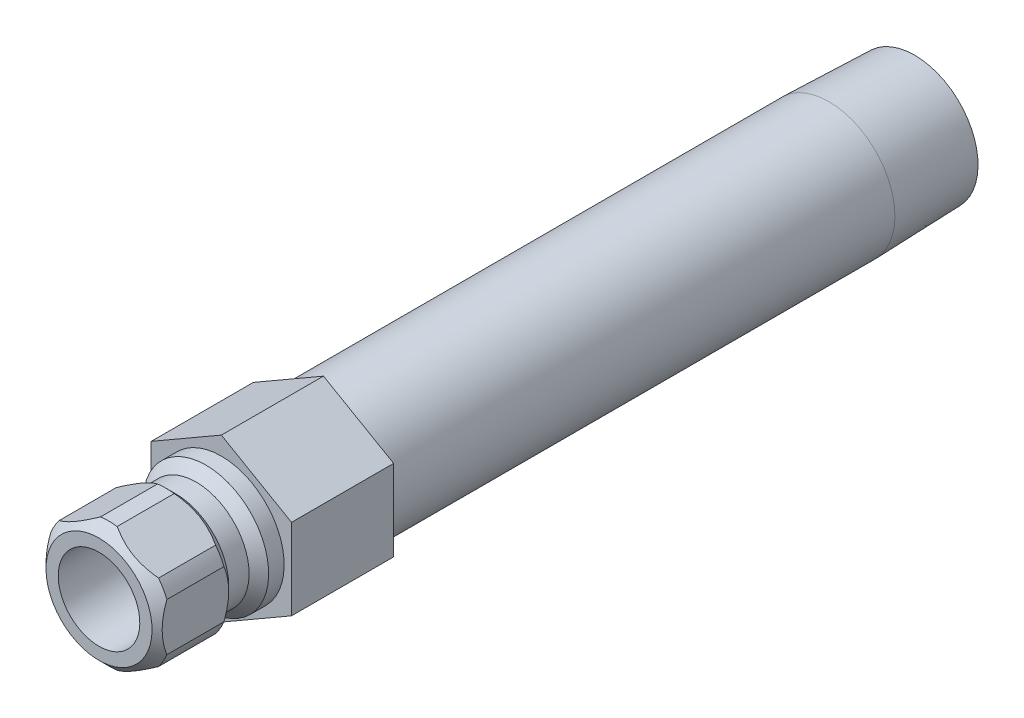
ISO-10303-21;
HEADER;
FILE_DESCRIPTION(('STEP AP214'),'2;1');
FILE_NAME('part.step','',(''),(''),'','','');
FILE_SCHEMA(('AUTOMOTIVE_DESIGN { 1 0 10303 214 1 1 1 1 }'));
ENDSEC;
DATA;
#1=APPLICATION_CONTEXT('core data for automotive mechanical design processes');
#2=APPLICATION_PROTOCOL_DEFINITION('international standard','automotive_design',2000,#1);
#3=PRODUCT_CONTEXT('',#1,'mechanical');
#4=PRODUCT('Part','Part','',(#3));
#5=PRODUCT_RELATED_PRODUCT_CATEGORY('part','',(#4));
#6=PRODUCT_DEFINITION_FORMATION('','',#4);
#7=PRODUCT_DEFINITION_CONTEXT('part definition',#1,'design');
#8=PRODUCT_DEFINITION('design','',#6,#7);
#9=PRODUCT_DEFINITION_SHAPE('','',#8);
#10=(LENGTH_UNIT() NAMED_UNIT(*) SI_UNIT(.MILLI.,.METRE.));
#11=(NAMED_UNIT(*) PLANE_ANGLE_UNIT() SI_UNIT($,.RADIAN.));
#12=(NAMED_UNIT(*) SI_UNIT($,.STERADIAN.) SOLID_ANGLE_UNIT());
#13=UNCERTAINTY_MEASURE_WITH_UNIT(LENGTH_MEASURE(1.E-05),#10,'distance_accuracy_value','');
#14=(GEOMETRIC_REPRESENTATION_CONTEXT(3) GLOBAL_UNCERTAINTY_ASSIGNED_CONTEXT((#13)) GLOBAL_UNIT_ASSIGNED_CONTEXT((#10,
#11,#12)) REPRESENTATION_CONTEXT('',''));
#15=CARTESIAN_POINT('',(0.,0.,0.));
#16=DIRECTION('',(0.,0.,1.));
#17=DIRECTION('',(1.,0.,0.));
#18=AXIS2_PLACEMENT_3D('',#15,#16,#17);
#19=CARTESIAN_POINT('',(0.,0.,0.));
#20=DIRECTION('',(0.,0.,-1.));
#21=DIRECTION('',(0.,1.,0.));
#22=AXIS2_PLACEMENT_3D('',#19,#20,#21);
#23=CYLINDRICAL_SURFACE('',#22,4.8895);
#24=DIRECTION('',(0.,0.,-1.));
#25=VECTOR('',#24,1.);
#26=CARTESIAN_POINT('',(-4.5212,-1.86170910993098,0.));
#27=LINE('',#26,#25);
#28=CARTESIAN_POINT('',(-4.5212,-1.86170910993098,4.318));
#29=VERTEX_POINT('',#28);
#30=CARTESIAN_POINT('',(-4.5212,-1.86170910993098,8.763));
#31=VERTEX_POINT('',#30);
#32=EDGE_CURVE('E61',#29,#31,#27,.F.);
#33=ORIENTED_EDGE('',*,*,#32,.F.);
#34=CARTESIAN_POINT('',(0.,0.,4.318));
#35=DIRECTION('',(0.,0.,-1.));
#36=DIRECTION('',(0.,1.,0.));
#37=AXIS2_PLACEMENT_3D('',#34,#35,#36);
#38=CIRCLE('',#37,4.8895);
#39=CARTESIAN_POINT('',(-3.87288738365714,-2.98461950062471,4.318));
#40=VERTEX_POINT('',#39);
#41=EDGE_CURVE('E650',#40,#29,#38,.T.);
#42=ORIENTED_EDGE('',*,*,#41,.F.);
#43=DIRECTION('',(0.,0.,-1.));
#44=VECTOR('',#43,1.);
#45=CARTESIAN_POINT('',(-3.87288738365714,-2.98461950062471,0.));
#46=LINE('',#45,#44);
#47=CARTESIAN_POINT('',(-3.87288738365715,-2.98461950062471,8.763));
#48=VERTEX_POINT('',#47);
#49=EDGE_CURVE('E218',#48,#40,#46,.T.);
#50=ORIENTED_EDGE('',*,*,#49,.F.);
#51=CARTESIAN_POINT('',(0.,0.,8.763));
#52=DIRECTION('',(0.,0.,-1.));
#53=DIRECTION('',(0.,1.,0.));
#54=AXIS2_PLACEMENT_3D('',#51,#52,#53);
#55=CIRCLE('',#54,4.8895);
#56=EDGE_CURVE('E189',#48,#31,#55,.T.);
#57=ORIENTED_EDGE('',*,*,#56,.T.);
#58=EDGE_LOOP('',(#33,#42,#50,#57));
#59=FACE_BOUND('',#58,.T.);
#60=ADVANCED_FACE('F34',(#59),#23,.T.);
#61=DIRECTION('',(0.,0.,-1.));
#62=VECTOR('',#61,1.);
#63=CARTESIAN_POINT('',(-0.648312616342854,-4.84632861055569,0.));
#64=LINE('',#63,#62);
#65=CARTESIAN_POINT('',(-0.648312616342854,-4.84632861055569,4.318));
#66=VERTEX_POINT('',#65);
#67=CARTESIAN_POINT('',(-0.648312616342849,-4.84632861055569,8.763));
#68=VERTEX_POINT('',#67);
#69=EDGE_CURVE('E232',#66,#68,#64,.F.);
#70=ORIENTED_EDGE('',*,*,#69,.F.);
#71=CARTESIAN_POINT('',(0.648312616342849,-4.84632861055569,4.318));
#72=VERTEX_POINT('',#71);
#73=EDGE_CURVE('E388',#72,#66,#38,.T.);
#74=ORIENTED_EDGE('',*,*,#73,.F.);
#75=DIRECTION('',(0.,0.,-1.));
#76=VECTOR('',#75,1.);
#77=CARTESIAN_POINT('',(0.648312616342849,-4.84632861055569,0.));
#78=LINE('',#77,#76);
#79=CARTESIAN_POINT('',(0.648312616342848,-4.84632861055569,8.763));
#80=VERTEX_POINT('',#79);
#81=EDGE_CURVE('E654',#80,#72,#78,.T.);
#82=ORIENTED_EDGE('',*,*,#81,.F.);
#83=EDGE_CURVE('E202',#80,#68,#55,.T.);
#84=ORIENTED_EDGE('',*,*,#83,.T.);
#85=EDGE_LOOP('',(#70,#74,#82,#84));
#86=FACE_BOUND('',#85,.T.);
#87=ADVANCED_FACE('F351',(#86),#23,.T.);
#88=DIRECTION('',(0.,0.,-1.));
#89=VECTOR('',#88,1.);
#90=CARTESIAN_POINT('',(3.87288738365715,-2.98461950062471,0.));
#91=LINE('',#90,#89);
#92=CARTESIAN_POINT('',(3.87288738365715,-2.98461950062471,4.318));
#93=VERTEX_POINT('',#92);
#94=CARTESIAN_POINT('',(3.87288738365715,-2.98461950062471,8.763));
#95=VERTEX_POINT('',#94);
#96=EDGE_CURVE('E294',#93,#95,#91,.F.);
#97=ORIENTED_EDGE('',*,*,#96,.F.);
#98=CARTESIAN_POINT('',(4.5212,-1.86170910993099,4.318));
#99=VERTEX_POINT('',#98);
#100=EDGE_CURVE('E384',#99,#93,#38,.T.);
#101=ORIENTED_EDGE('',*,*,#100,.F.);
#102=DIRECTION('',(0.,0.,-1.));
#103=VECTOR('',#102,1.);
#104=CARTESIAN_POINT('',(4.5212,-1.86170910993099,0.));
#105=LINE('',#104,#103);
#106=CARTESIAN_POINT('',(4.5212,-1.86170910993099,8.763));
#107=VERTEX_POINT('',#106);
#108=EDGE_CURVE('E377',#107,#99,#105,.T.);
#109=ORIENTED_EDGE('',*,*,#108,.F.);
#110=EDGE_CURVE('E195',#107,#95,#55,.T.);
#111=ORIENTED_EDGE('',*,*,#110,.T.);
#112=EDGE_LOOP('',(#97,#101,#109,#111));
#113=FACE_BOUND('',#112,.T.);
#114=ADVANCED_FACE('F355',(#113),#23,.T.);
#115=DIRECTION('',(0.,0.,-1.));
#116=VECTOR('',#115,1.);
#117=CARTESIAN_POINT('',(4.5212,1.86170910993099,0.));
#118=LINE('',#117,#116);
#119=CARTESIAN_POINT('',(4.5212,1.86170910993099,4.318));
#120=VERTEX_POINT('',#119);
#121=CARTESIAN_POINT('',(4.5212,1.86170910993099,8.763));
#122=VERTEX_POINT('',#121);
#123=EDGE_CURVE('E373',#120,#122,#118,.F.);
#124=ORIENTED_EDGE('',*,*,#123,.F.);
#125=CARTESIAN_POINT('',(3.87288738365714,2.98461950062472,4.318));
#126=VERTEX_POINT('',#125);
#127=EDGE_CURVE('E200',#126,#120,#38,.T.);
#128=ORIENTED_EDGE('',*,*,#127,.F.);
#129=DIRECTION('',(0.,0.,-1.));
#130=VECTOR('',#129,1.);
#131=CARTESIAN_POINT('',(3.87288738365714,2.98461950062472,0.));
#132=LINE('',#131,#130);
#133=CARTESIAN_POINT('',(3.87288738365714,2.98461950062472,8.763));
#134=VERTEX_POINT('',#133);
#135=EDGE_CURVE('E651',#134,#126,#132,.T.);
#136=ORIENTED_EDGE('',*,*,#135,.F.);
#137=EDGE_CURVE('E188',#134,#122,#55,.T.);
#138=ORIENTED_EDGE('',*,*,#137,.T.);
#139=EDGE_LOOP('',(#124,#128,#136,#138));
#140=FACE_BOUND('',#139,.T.);
#141=ADVANCED_FACE('F361',(#140),#23,.T.);
#142=DIRECTION('',(0.,0.,-1.));
#143=VECTOR('',#142,1.);
#144=CARTESIAN_POINT('',(0.648312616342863,4.84632861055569,0.));
#145=LINE('',#144,#143);
#146=CARTESIAN_POINT('',(0.648312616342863,4.84632861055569,4.318));
#147=VERTEX_POINT('',#146);
#148=CARTESIAN_POINT('',(0.648312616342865,4.84632861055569,8.763));
#149=VERTEX_POINT('',#148);
#150=EDGE_CURVE('E652',#147,#149,#145,.F.);
#151=ORIENTED_EDGE('',*,*,#150,.F.);
#152=CARTESIAN_POINT('',(-0.648312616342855,4.84632861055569,4.318));
#153=VERTEX_POINT('',#152);
#154=EDGE_CURVE('E179',#153,#147,#38,.T.);
#155=ORIENTED_EDGE('',*,*,#154,.F.);
#156=DIRECTION('',(0.,0.,-1.));
#157=VECTOR('',#156,1.);
#158=CARTESIAN_POINT('',(-0.648312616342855,4.84632861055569,0.));
#159=LINE('',#158,#157);
#160=CARTESIAN_POINT('',(-0.648312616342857,4.84632861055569,8.763));
#161=VERTEX_POINT('',#160);
#162=EDGE_CURVE('E163',#161,#153,#159,.T.);
#163=ORIENTED_EDGE('',*,*,#162,.F.);
#164=EDGE_CURVE('E177',#161,#149,#55,.T.);
#165=ORIENTED_EDGE('',*,*,#164,.T.);
#166=EDGE_LOOP('',(#151,#155,#163,#165));
#167=FACE_BOUND('',#166,.T.);
#168=ADVANCED_FACE('F176',(#167),#23,.T.);
#169=CARTESIAN_POINT('',(0.,4.8895,0.));
#170=DIRECTION('',(0.,0.,1.));
#171=DIRECTION('',(0.,-1.,0.));
#172=AXIS2_PLACEMENT_3D('',#169,#170,#171);
#173=PLANE('',#172);
#174=CARTESIAN_POINT('',(0.,0.,0.));
#175=DIRECTION('',(0.,0.,-1.));
#176=DIRECTION('',(0.,1.,0.));
#177=AXIS2_PLACEMENT_3D('',#174,#175,#176);
#178=CIRCLE('',#177,4.8895);
#179=CARTESIAN_POINT('',(0.,4.8895,0.));
#180=VERTEX_POINT('',#179);
#181=EDGE_CURVE('E395',#180,#180,#178,.T.);
#182=ORIENTED_EDGE('',*,*,#181,.T.);
#183=EDGE_LOOP('',(#182));
#184=FACE_BOUND('',#183,.T.);
#185=DIRECTION('',(-0.866025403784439,-0.5,0.));
#186=VECTOR('',#185,1.);
#187=CARTESIAN_POINT('',(0.,6.3058196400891,0.));
#188=LINE('',#187,#186);
#189=CARTESIAN_POINT('',(0.,6.3058196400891,0.));
#190=VERTEX_POINT('',#189);
#191=CARTESIAN_POINT('',(-5.461,3.15290982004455,0.));
#192=VERTEX_POINT('',#191);
#193=EDGE_CURVE('E445',#190,#192,#188,.T.);
#194=ORIENTED_EDGE('',*,*,#193,.T.);
#195=DIRECTION('',(0.,-1.,0.));
#196=VECTOR('',#195,1.);
#197=CARTESIAN_POINT('',(-5.461,3.15290982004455,0.));
#198=LINE('',#197,#196);
#199=CARTESIAN_POINT('',(-5.461,-3.15290982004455,0.));
#200=VERTEX_POINT('',#199);
#201=EDGE_CURVE('E448',#192,#200,#198,.T.);
#202=ORIENTED_EDGE('',*,*,#201,.T.);
#203=DIRECTION('',(0.866025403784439,-0.5,0.));
#204=VECTOR('',#203,1.);
#205=CARTESIAN_POINT('',(-5.461,-3.15290982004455,0.));
#206=LINE('',#205,#204);
#207=CARTESIAN_POINT('',(0.,-6.30581964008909,0.));
#208=VERTEX_POINT('',#207);
#209=EDGE_CURVE('E451',#200,#208,#206,.T.);
#210=ORIENTED_EDGE('',*,*,#209,.T.);
#211=DIRECTION('',(0.866025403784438,0.5,0.));
#212=VECTOR('',#211,1.);
#213=CARTESIAN_POINT('',(0.,-6.30581964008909,0.));
#214=LINE('',#213,#212);
#215=CARTESIAN_POINT('',(5.461,-3.15290982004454,0.));
#216=VERTEX_POINT('',#215);
#217=EDGE_CURVE('E454',#208,#216,#214,.T.);
#218=ORIENTED_EDGE('',*,*,#217,.T.);
#219=DIRECTION('',(0.,1.,0.));
#220=VECTOR('',#219,1.);
#221=CARTESIAN_POINT('',(5.461,-3.15290982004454,0.));
#222=LINE('',#221,#220);
#223=CARTESIAN_POINT('',(5.461,3.15290982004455,0.));
#224=VERTEX_POINT('',#223);
#225=EDGE_CURVE('E456',#216,#224,#222,.T.);
#226=ORIENTED_EDGE('',*,*,#225,.T.);
#227=DIRECTION('',(-0.866025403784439,0.5,0.));
#228=VECTOR('',#227,1.);
#229=CARTESIAN_POINT('',(5.461,3.15290982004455,0.));
#230=LINE('',#229,#228);
#231=EDGE_CURVE('E424',#224,#190,#230,.T.);
#232=ORIENTED_EDGE('',*,*,#231,.T.);
#233=EDGE_LOOP('',(#194,#202,#210,#218,#226,#232));
#234=FACE_BOUND('',#233,.T.);
#235=ADVANCED_FACE('F360',(#184,#234),#173,.T.);
#236=CARTESIAN_POINT('',(0.,0.,0.));
#237=DIRECTION('',(0.,0.,-1.));
#238=DIRECTION('',(0.,1.,0.));
#239=AXIS2_PLACEMENT_3D('',#236,#237,#238);
#240=CYLINDRICAL_SURFACE('',#239,4.8895);
#241=CARTESIAN_POINT('',(0.,0.,1.2065));
#242=DIRECTION('',(0.,0.,-1.));
#243=DIRECTION('',(0.,1.,0.));
#244=AXIS2_PLACEMENT_3D('',#241,#242,#243);
#245=CIRCLE('',#244,4.8895);
#246=CARTESIAN_POINT('',(0.,4.8895,1.2065));
#247=VERTEX_POINT('',#246);
#248=EDGE_CURVE('E392',#247,#247,#245,.T.);
#249=ORIENTED_EDGE('',*,*,#248,.T.);
#250=EDGE_LOOP('',(#249));
#251=FACE_BOUND('',#250,.T.);
#252=ORIENTED_EDGE('',*,*,#181,.F.);
#253=EDGE_LOOP('',(#252));
#254=FACE_BOUND('',#253,.T.);
#255=ADVANCED_FACE('F366',(#251,#254),#240,.T.);
#256=CARTESIAN_POINT('',(0.,0.,1.2065));
#257=DIRECTION('',(0.,0.,-1.));
#258=DIRECTION('',(0.,1.,0.));
#259=AXIS2_PLACEMENT_3D('',#256,#257,#258);
#260=CONICAL_SURFACE('',#259,4.8895,0.785398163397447);
#261=CARTESIAN_POINT('',(0.,0.,1.9685));
#262=DIRECTION('',(0.,0.,-1.));
#263=DIRECTION('',(0.,1.,0.));
#264=AXIS2_PLACEMENT_3D('',#261,#262,#263);
#265=CIRCLE('',#264,4.1275);
#266=CARTESIAN_POINT('',(0.,4.1275,1.9685));
#267=VERTEX_POINT('',#266);
#268=EDGE_CURVE('E386',#267,#267,#265,.T.);
#269=ORIENTED_EDGE('',*,*,#268,.T.);
#270=EDGE_LOOP('',(#269));
#271=FACE_BOUND('',#270,.T.);
#272=ORIENTED_EDGE('',*,*,#248,.F.);
#273=EDGE_LOOP('',(#272));
#274=FACE_BOUND('',#273,.T.);
#275=ADVANCED_FACE('F704',(#271,#274),#260,.T.);
#276=CARTESIAN_POINT('',(0.,0.,0.));
#277=DIRECTION('',(0.,0.,-1.));
#278=DIRECTION('',(0.,1.,0.));
#279=AXIS2_PLACEMENT_3D('',#276,#277,#278);
#280=CYLINDRICAL_SURFACE('',#279,4.1275);
#281=CARTESIAN_POINT('',(0.,0.,3.556));
#282=DIRECTION('',(0.,0.,-1.));
#283=DIRECTION('',(0.,1.,0.));
#284=AXIS2_PLACEMENT_3D('',#281,#282,#283);
#285=CIRCLE('',#284,4.1275);
#286=CARTESIAN_POINT('',(0.,4.1275,3.556));
#287=VERTEX_POINT('',#286);
#288=EDGE_CURVE('E383',#287,#287,#285,.T.);
#289=ORIENTED_EDGE('',*,*,#288,.T.);
#290=EDGE_LOOP('',(#289));
#291=FACE_BOUND('',#290,.T.);
#292=ORIENTED_EDGE('',*,*,#268,.F.);
#293=EDGE_LOOP('',(#292));
#294=FACE_BOUND('',#293,.T.);
#295=ADVANCED_FACE('F254',(#291,#294),#280,.T.);
#296=CARTESIAN_POINT('',(0.,0.,3.556));
#297=DIRECTION('',(0.,0.,1.));
#298=DIRECTION('',(0.,-1.,0.));
#299=AXIS2_PLACEMENT_3D('',#296,#297,#298);
#300=CONICAL_SURFACE('',#299,4.1275,0.785398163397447);
#301=CARTESIAN_POINT('',(-4.5212,-5.15925306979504,6.2884665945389));
#302=CARTESIAN_POINT('',(-4.5212,-5.03341781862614,6.19384981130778));
#303=CARTESIAN_POINT('',(-4.5212,-4.90687282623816,6.10016148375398));
#304=CARTESIAN_POINT('',(-4.5212,-4.65208542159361,5.91505573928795));
#305=CARTESIAN_POINT('',(-4.5212,-4.52384258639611,5.82363890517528));
#306=CARTESIAN_POINT('',(-4.5212,-4.26444371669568,5.64284060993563));
#307=CARTESIAN_POINT('',(-4.5212,-4.13327280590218,5.55348041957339));
#308=CARTESIAN_POINT('',(-4.5212,-3.86869655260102,5.37814219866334));
#309=CARTESIAN_POINT('',(-4.5212,-3.735291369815,5.29216392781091));
#310=CARTESIAN_POINT('',(-4.5212,-3.45835736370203,5.1196421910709));
#311=CARTESIAN_POINT('',(-4.5212,-3.31467977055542,5.03333631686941));
#312=CARTESIAN_POINT('',(-4.5212,-3.02397608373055,4.86646929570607));
#313=CARTESIAN_POINT('',(-4.5212,-2.87694947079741,4.78590904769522));
#314=CARTESIAN_POINT('',(-4.5212,-2.57957206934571,4.6322757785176));
#315=CARTESIAN_POINT('',(-4.5212,-2.42923274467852,4.55918074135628));
#316=CARTESIAN_POINT('',(-4.5212,-2.12448469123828,4.42211381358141));
#317=CARTESIAN_POINT('',(-4.5212,-1.97007782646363,4.35813782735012));
#318=CARTESIAN_POINT('',(-4.5212,-1.66898205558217,4.24604782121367));
#319=CARTESIAN_POINT('',(-4.5212,-1.52260919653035,4.19709368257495));
#320=CARTESIAN_POINT('',(-4.5212,-1.22638031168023,4.11093488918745));
#321=CARTESIAN_POINT('',(-4.5212,-1.07652404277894,4.07373105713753));
#322=CARTESIAN_POINT('',(-4.5212,-0.776693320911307,4.01362130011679));
#323=CARTESIAN_POINT('',(-4.5212,-0.626768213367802,3.99047322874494));
#324=CARTESIAN_POINT('',(-4.5212,-0.325366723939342,3.95891692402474));
#325=CARTESIAN_POINT('',(-4.5212,-0.173890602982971,3.95050625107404));
#326=CARTESIAN_POINT('',(-4.5212,0.123852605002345,3.94903068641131));
#327=CARTESIAN_POINT('',(-4.5212,0.270117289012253,3.95544130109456));
#328=CARTESIAN_POINT('',(-4.5212,0.561370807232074,3.98210770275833));
#329=CARTESIAN_POINT('',(-4.5212,0.706359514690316,4.0023648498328));
#330=CARTESIAN_POINT('',(-4.5212,0.996462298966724,4.05597163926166));
#331=CARTESIAN_POINT('',(-4.5212,1.14153485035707,4.08954247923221));
#332=CARTESIAN_POINT('',(-4.5212,1.42852462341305,4.16800024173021));
#333=CARTESIAN_POINT('',(-4.5212,1.5704421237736,4.21288616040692));
#334=CARTESIAN_POINT('',(-4.5212,1.86505501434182,4.3171412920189));
#335=CARTESIAN_POINT('',(-4.5212,2.01739126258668,4.37751543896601));
#336=CARTESIAN_POINT('',(-4.5212,2.31809735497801,4.5075182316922));
#337=CARTESIAN_POINT('',(-4.5212,2.46646529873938,4.57715121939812));
#338=CARTESIAN_POINT('',(-4.5212,2.75996557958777,4.72401353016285));
#339=CARTESIAN_POINT('',(-4.5212,2.90508583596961,4.80126680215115));
#340=CARTESIAN_POINT('',(-4.5212,3.19198335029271,4.96166050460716));
#341=CARTESIAN_POINT('',(-4.5212,3.33376113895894,5.04479999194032));
#342=CARTESIAN_POINT('',(-4.5212,3.60742153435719,5.21154136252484));
#343=CARTESIAN_POINT('',(-4.5212,3.73944496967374,5.29491333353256));
#344=CARTESIAN_POINT('',(-4.5212,4.00122581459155,5.4651527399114));
#345=CARTESIAN_POINT('',(-4.5212,4.13098305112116,5.55202044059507));
#346=CARTESIAN_POINT('',(-4.5212,4.387473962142,5.72790624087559));
#347=CARTESIAN_POINT('',(-4.5212,4.51422365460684,5.81690106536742));
#348=CARTESIAN_POINT('',(-4.5212,4.76599253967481,5.99723636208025));
#349=CARTESIAN_POINT('',(-4.5212,4.8910121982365,6.08857618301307));
#350=CARTESIAN_POINT('',(-4.5212,5.01530771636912,6.18087446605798));
#351=B_SPLINE_CURVE_WITH_KNOTS('',3,(#301,#302,#303,#304,#305,#306,#307,#308,#309,#310,#311,
#312,#313,#314,#315,#316,#317,#318,#319,#320,#321,#322,#323,#324,#325,#326,#327,#328,#329,#330,
#331,#332,#333,#334,#335,#336,#337,#338,#339,#340,#341,#342,#343,#344,#345,#346,#347,#348,#349,
#350),.UNSPECIFIED.,.F.,.F.,(4,2,2,2,2,2,2,2,2,2,2,2,2,2,2,2,2,2,2,2,2,2,2,2,4),(0.,
0.472324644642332,0.944769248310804,1.42087610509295,1.89694907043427,2.39966187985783,
2.90245317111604,3.40371602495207,3.90475303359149,4.3673713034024,4.83002195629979,
5.28445770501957,5.73881822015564,6.1773471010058,6.615919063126,7.06210522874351,
7.50825182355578,7.9994594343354,8.49089821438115,8.98393391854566,9.47689080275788,
9.94525924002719,10.4136632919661,10.8782525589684,11.3427141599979),.UNSPECIFIED.);
#352=CARTESIAN_POINT('',(-4.5212,1.86170910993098,4.318));
#353=VERTEX_POINT('',#352);
#354=EDGE_CURVE('E230',#353,#29,#351,.F.);
#355=ORIENTED_EDGE('',*,*,#354,.F.);
#356=CARTESIAN_POINT('',(-3.87288738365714,2.98461950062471,4.318));
#357=VERTEX_POINT('',#356);
#358=EDGE_CURVE('E199',#353,#357,#38,.T.);
#359=ORIENTED_EDGE('',*,*,#358,.T.);
#360=CARTESIAN_POINT('',(-0.647857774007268,4.84659121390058,4.3182));
#361=CARTESIAN_POINT('',(-0.775261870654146,4.77303442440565,4.26213711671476));
#362=CARTESIAN_POINT('',(-0.904457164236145,4.69844348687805,4.21102627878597));
#363=CARTESIAN_POINT('',(-1.16629518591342,4.5472712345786,4.12074318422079));
#364=CARTESIAN_POINT('',(-1.29894624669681,4.47068510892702,4.08160338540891));
#365=CARTESIAN_POINT('',(-1.56203676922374,4.31878972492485,4.01877592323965));
#366=CARTESIAN_POINT('',(-1.69238331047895,4.24353411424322,3.99458163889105));
#367=CARTESIAN_POINT('',(-1.95434729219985,4.09228913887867,3.96102228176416));
#368=CARTESIAN_POINT('',(-2.0859628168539,4.01630088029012,3.95163757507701));
#369=CARTESIAN_POINT('',(-2.35623055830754,3.86026172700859,3.9482192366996));
#370=CARTESIAN_POINT('',(-2.49489129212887,3.78020591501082,3.95501290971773));
#371=CARTESIAN_POINT('',(-2.7710334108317,3.62077518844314,3.98518499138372));
#372=CARTESIAN_POINT('',(-2.90851272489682,3.54140146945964,4.00858815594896));
#373=CARTESIAN_POINT('',(-3.18622016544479,3.38106700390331,4.07155129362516));
#374=CARTESIAN_POINT('',(-3.32634361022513,3.3001666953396,4.11171074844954));
#375=CARTESIAN_POINT('',(-3.60275664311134,3.14057955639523,4.20550294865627));
#376=CARTESIAN_POINT('',(-3.73905611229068,3.06188702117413,4.2590965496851));
#377=CARTESIAN_POINT('',(-3.87334222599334,2.98435689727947,4.31820000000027));
#378=B_SPLINE_CURVE_WITH_KNOTS('',3,(#360,#361,#362,#363,#364,#365,#366,#367,#368,#369,#370,
#371,#372,#373,#374,#375,#376,#377),.UNSPECIFIED.,.F.,.F.,(4,2,2,2,2,2,2,2,4),(0.,
0.472469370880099,0.946208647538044,1.40285320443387,1.85889185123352,2.33874707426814,
2.81931901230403,3.31879975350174,3.81684169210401),.UNSPECIFIED.);
#379=EDGE_CURVE('E260',#153,#357,#378,.T.);
#380=ORIENTED_EDGE('',*,*,#379,.F.);
#381=ORIENTED_EDGE('',*,*,#154,.T.);
#382=CARTESIAN_POINT('',(3.87334222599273,2.98435689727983,4.3182));
#383=CARTESIAN_POINT('',(3.74593812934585,3.05791368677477,4.26213711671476));
#384=CARTESIAN_POINT('',(3.61674283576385,3.13250462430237,4.21102627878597));
#385=CARTESIAN_POINT('',(3.35490481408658,3.28367687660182,4.12074318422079));
#386=CARTESIAN_POINT('',(3.22225375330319,3.3602630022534,4.08160338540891));
#387=CARTESIAN_POINT('',(2.95916323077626,3.51215838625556,4.01877592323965));
#388=CARTESIAN_POINT('',(2.82881668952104,3.5874139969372,3.99458163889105));
#389=CARTESIAN_POINT('',(2.56685270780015,3.73865897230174,3.96102228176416));
#390=CARTESIAN_POINT('',(2.4352371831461,3.81464723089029,3.95163757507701));
#391=CARTESIAN_POINT('',(2.16496944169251,3.97068638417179,3.94821923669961));
#392=CARTESIAN_POINT('',(2.02630870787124,4.05074219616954,3.95501290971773));
#393=CARTESIAN_POINT('',(1.75016658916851,4.21017292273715,3.98518499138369));
#394=CARTESIAN_POINT('',(1.61268727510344,4.28954664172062,4.00858815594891));
#395=CARTESIAN_POINT('',(1.33497983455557,4.44988110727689,4.07155129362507));
#396=CARTESIAN_POINT('',(1.19485638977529,4.53078141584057,4.11171074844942));
#397=CARTESIAN_POINT('',(0.918443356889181,4.69036855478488,4.20550294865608));
#398=CARTESIAN_POINT('',(0.782143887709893,4.76906109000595,4.25909654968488));
#399=CARTESIAN_POINT('',(0.647857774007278,4.84659121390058,4.3182));
#400=B_SPLINE_CURVE_WITH_KNOTS('',3,(#382,#383,#384,#385,#386,#387,#388,#389,#390,#391,#392,
#393,#394,#395,#396,#397,#398,#399),.UNSPECIFIED.,.F.,.F.,(4,2,2,2,2,2,2,2,4),(0.,
0.472469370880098,0.946208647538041,1.40285320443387,1.85889185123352,2.33874707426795,
2.81931901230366,3.31879975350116,3.81684169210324),.UNSPECIFIED.);
#401=EDGE_CURVE('E270',#126,#147,#400,.T.);
#402=ORIENTED_EDGE('',*,*,#401,.F.);
#403=ORIENTED_EDGE('',*,*,#127,.T.);
#404=CARTESIAN_POINT('',(4.5212,-5.15925306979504,6.2884665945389));
#405=CARTESIAN_POINT('',(4.5212,-5.03341781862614,6.19384981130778));
#406=CARTESIAN_POINT('',(4.5212,-4.90687282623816,6.10016148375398));
#407=CARTESIAN_POINT('',(4.5212,-4.65208542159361,5.91505573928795));
#408=CARTESIAN_POINT('',(4.5212,-4.52384258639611,5.82363890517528));
#409=CARTESIAN_POINT('',(4.5212,-4.26444371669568,5.64284060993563));
#410=CARTESIAN_POINT('',(4.5212,-4.13327280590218,5.55348041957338));
#411=CARTESIAN_POINT('',(4.5212,-3.86869655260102,5.37814219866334));
#412=CARTESIAN_POINT('',(4.5212,-3.735291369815,5.2921639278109));
#413=CARTESIAN_POINT('',(4.5212,-3.45835736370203,5.1196421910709));
#414=CARTESIAN_POINT('',(4.5212,-3.31467977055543,5.03333631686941));
#415=CARTESIAN_POINT('',(4.5212,-3.02397608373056,4.86646929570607));
#416=CARTESIAN_POINT('',(4.5212,-2.87694947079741,4.78590904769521));
#417=CARTESIAN_POINT('',(4.5212,-2.57957206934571,4.63227577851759));
#418=CARTESIAN_POINT('',(4.5212,-2.42923274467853,4.55918074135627));
#419=CARTESIAN_POINT('',(4.5212,-2.12448469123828,4.4221138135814));
#420=CARTESIAN_POINT('',(4.5212,-1.97007782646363,4.35813782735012));
#421=CARTESIAN_POINT('',(4.5212,-1.66898205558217,4.24604782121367));
#422=CARTESIAN_POINT('',(4.5212,-1.52260919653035,4.19709368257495));
#423=CARTESIAN_POINT('',(4.5212,-1.22638031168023,4.11093488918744));
#424=CARTESIAN_POINT('',(4.5212,-1.07652404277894,4.07373105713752));
#425=CARTESIAN_POINT('',(4.5212,-0.776693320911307,4.01362130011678));
#426=CARTESIAN_POINT('',(4.5212,-0.626768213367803,3.99047322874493));
#427=CARTESIAN_POINT('',(4.5212,-0.325366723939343,3.95891692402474));
#428=CARTESIAN_POINT('',(4.5212,-0.173890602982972,3.95050625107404));
#429=CARTESIAN_POINT('',(4.5212,0.123852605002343,3.94903068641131));
#430=CARTESIAN_POINT('',(4.5212,0.27011728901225,3.95544130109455));
#431=CARTESIAN_POINT('',(4.5212,0.561370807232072,3.98210770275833));
#432=CARTESIAN_POINT('',(4.5212,0.706359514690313,4.0023648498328));
#433=CARTESIAN_POINT('',(4.5212,0.99646229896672,4.05597163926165));
#434=CARTESIAN_POINT('',(4.5212,1.14153485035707,4.08954247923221));
#435=CARTESIAN_POINT('',(4.5212,1.42852462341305,4.16800024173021));
#436=CARTESIAN_POINT('',(4.5212,1.5704421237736,4.21288616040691));
#437=CARTESIAN_POINT('',(4.5212,1.86505501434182,4.3171412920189));
#438=CARTESIAN_POINT('',(4.5212,2.01739126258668,4.377515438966));
#439=CARTESIAN_POINT('',(4.5212,2.318097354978,4.50751823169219));
#440=CARTESIAN_POINT('',(4.5212,2.46646529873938,4.57715121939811));
#441=CARTESIAN_POINT('',(4.5212,2.75996557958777,4.72401353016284));
#442=CARTESIAN_POINT('',(4.5212,2.9050858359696,4.80126680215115));
#443=CARTESIAN_POINT('',(4.5212,3.1919833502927,4.96166050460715));
#444=CARTESIAN_POINT('',(4.5212,3.33376113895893,5.04479999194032));
#445=CARTESIAN_POINT('',(4.5212,3.60742153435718,5.21154136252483));
#446=CARTESIAN_POINT('',(4.5212,3.73944496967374,5.29491333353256));
#447=CARTESIAN_POINT('',(4.5212,4.00122581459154,5.46515273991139));
#448=CARTESIAN_POINT('',(4.5212,4.13098305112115,5.55202044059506));
#449=CARTESIAN_POINT('',(4.5212,4.38747396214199,5.72790624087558));
#450=CARTESIAN_POINT('',(4.5212,4.51422365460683,5.81690106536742));
#451=CARTESIAN_POINT('',(4.5212,4.76599253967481,5.99723636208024));
#452=CARTESIAN_POINT('',(4.5212,4.89101219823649,6.08857618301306));
#453=CARTESIAN_POINT('',(4.5212,5.01530771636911,6.18087446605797));
#454=B_SPLINE_CURVE_WITH_KNOTS('',3,(#404,#405,#406,#407,#408,#409,#410,#411,#412,#413,#414,
#415,#416,#417,#418,#419,#420,#421,#422,#423,#424,#425,#426,#427,#428,#429,#430,#431,#432,#433,
#434,#435,#436,#437,#438,#439,#440,#441,#442,#443,#444,#445,#446,#447,#448,#449,#450,#451,#452,
#453),.UNSPECIFIED.,.F.,.F.,(4,2,2,2,2,2,2,2,2,2,2,2,2,2,2,2,2,2,2,2,2,2,2,2,4),(0.,
0.472324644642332,0.944769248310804,1.42087610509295,1.89694907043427,2.39966187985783,
2.90245317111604,3.40371602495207,3.90475303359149,4.3673713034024,4.83002195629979,
5.28445770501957,5.73881822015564,6.1773471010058,6.615919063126,7.06210522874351,
7.50825182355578,7.9994594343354,8.49089821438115,8.98393391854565,9.47689080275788,
9.94525924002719,10.4136632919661,10.8782525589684,11.3427141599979),.UNSPECIFIED.);
#455=EDGE_CURVE('E279',#99,#120,#454,.T.);
#456=ORIENTED_EDGE('',*,*,#455,.F.);
#457=ORIENTED_EDGE('',*,*,#100,.T.);
#458=CARTESIAN_POINT('',(0.647857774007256,-4.84659121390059,4.3182));
#459=CARTESIAN_POINT('',(0.775261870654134,-4.77303442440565,4.26213711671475));
#460=CARTESIAN_POINT('',(0.904457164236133,-4.69844348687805,4.21102627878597));
#461=CARTESIAN_POINT('',(1.16629518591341,-4.5472712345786,4.12074318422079));
#462=CARTESIAN_POINT('',(1.2989462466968,-4.47068510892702,4.08160338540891));
#463=CARTESIAN_POINT('',(1.56203676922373,-4.31878972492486,4.01877592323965));
#464=CARTESIAN_POINT('',(1.69238331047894,-4.24353411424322,3.99458163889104));
#465=CARTESIAN_POINT('',(1.95434729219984,-4.09228913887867,3.96102228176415));
#466=CARTESIAN_POINT('',(2.08596281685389,-4.01630088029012,3.951637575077));
#467=CARTESIAN_POINT('',(2.35623055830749,-3.86026172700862,3.9482192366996));
#468=CARTESIAN_POINT('',(2.49489129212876,-3.78020591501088,3.95501290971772));
#469=CARTESIAN_POINT('',(2.77103341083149,-3.62077518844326,3.98518499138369));
#470=CARTESIAN_POINT('',(2.90851272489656,-3.54140146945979,4.0085881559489));
#471=CARTESIAN_POINT('',(3.18622016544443,-3.38106700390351,4.07155129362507));
#472=CARTESIAN_POINT('',(3.32634361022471,-3.30016669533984,4.11171074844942));
#473=CARTESIAN_POINT('',(3.60275664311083,-3.14057955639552,4.20550294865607));
#474=CARTESIAN_POINT('',(3.73905611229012,-3.06188702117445,4.25909654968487));
#475=CARTESIAN_POINT('',(3.87334222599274,-2.98435689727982,4.3182));
#476=B_SPLINE_CURVE_WITH_KNOTS('',3,(#458,#459,#460,#461,#462,#463,#464,#465,#466,#467,#468,
#469,#470,#471,#472,#473,#474,#475),.UNSPECIFIED.,.F.,.F.,(4,2,2,2,2,2,2,2,4),(0.,
0.4724693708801,0.946208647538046,1.40285320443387,1.85889185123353,2.33874707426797,
2.81931901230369,3.3187997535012,3.81684169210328),.UNSPECIFIED.);
#477=EDGE_CURVE('E287',#72,#93,#476,.T.);
#478=ORIENTED_EDGE('',*,*,#477,.F.);
#479=ORIENTED_EDGE('',*,*,#73,.T.);
#480=CARTESIAN_POINT('',(-3.87334222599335,-2.98435689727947,4.31820000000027));
#481=CARTESIAN_POINT('',(-3.74593812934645,-3.05791368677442,4.262137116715));
#482=CARTESIAN_POINT('',(-3.61674283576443,-3.13250462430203,4.21102627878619));
#483=CARTESIAN_POINT('',(-3.35490481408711,-3.28367687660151,4.12074318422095));
#484=CARTESIAN_POINT('',(-3.2222537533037,-3.3602630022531,4.08160338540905));
#485=CARTESIAN_POINT('',(-2.95916323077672,-3.51215838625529,4.01877592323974));
#486=CARTESIAN_POINT('',(-2.82881668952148,-3.58741399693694,3.99458163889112));
#487=CARTESIAN_POINT('',(-2.56685270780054,-3.73865897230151,3.96102228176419));
#488=CARTESIAN_POINT('',(-2.43523718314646,-3.81464723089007,3.95163757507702));
#489=CARTESIAN_POINT('',(-2.16496944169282,-3.97068638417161,3.94821923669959));
#490=CARTESIAN_POINT('',(-2.02630870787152,-4.05074219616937,3.95501290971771));
#491=CARTESIAN_POINT('',(-1.75016658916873,-4.21017292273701,3.98518499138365));
#492=CARTESIAN_POINT('',(-1.61268727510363,-4.2895466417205,4.00858815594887));
#493=CARTESIAN_POINT('',(-1.33497983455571,-4.44988110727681,4.07155129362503));
#494=CARTESIAN_POINT('',(-1.1948563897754,-4.5307814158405,4.11171074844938));
#495=CARTESIAN_POINT('',(-0.918443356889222,-4.69036855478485,4.20550294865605));
#496=CARTESIAN_POINT('',(-0.782143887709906,-4.76906109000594,4.25909654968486));
#497=CARTESIAN_POINT('',(-0.647857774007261,-4.84659121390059,4.3182));
#498=B_SPLINE_CURVE_WITH_KNOTS('',3,(#480,#481,#482,#483,#484,#485,#486,#487,#488,#489,#490,
#491,#492,#493,#494,#495,#496,#497),.UNSPECIFIED.,.F.,.F.,(4,2,2,2,2,2,2,2,4),(0.,
0.472469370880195,0.946208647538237,1.40285320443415,1.85889185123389,2.33874707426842,
2.81931901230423,3.31879975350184,3.81684169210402),.UNSPECIFIED.);
#499=EDGE_CURVE('E228',#40,#66,#498,.T.);
#500=ORIENTED_EDGE('',*,*,#499,.F.);
#501=ORIENTED_EDGE('',*,*,#41,.T.);
#502=EDGE_LOOP('',(#355,#359,#380,#381,#402,#403,#456,#457,#478,#479,#500,#501));
#503=FACE_BOUND('',#502,.T.);
#504=ORIENTED_EDGE('',*,*,#288,.F.);
#505=EDGE_LOOP('',(#504));
#506=FACE_BOUND('',#505,.T.);
#507=ADVANCED_FACE('F249',(#503,#506),#300,.T.);
#508=DIRECTION('',(0.,0.,-1.));
#509=VECTOR('',#508,1.);
#510=CARTESIAN_POINT('',(-4.5212,1.86170910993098,0.));
#511=LINE('',#510,#509);
#512=CARTESIAN_POINT('',(-4.5212,1.86170910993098,8.763));
#513=VERTEX_POINT('',#512);
#514=EDGE_CURVE('E222',#513,#353,#511,.T.);
#515=ORIENTED_EDGE('',*,*,#514,.F.);
#516=CARTESIAN_POINT('',(-3.87288738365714,2.98461950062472,8.763));
#517=VERTEX_POINT('',#516);
#518=EDGE_CURVE('E185',#513,#517,#55,.T.);
#519=ORIENTED_EDGE('',*,*,#518,.T.);
#520=DIRECTION('',(0.,0.,-1.));
#521=VECTOR('',#520,1.);
#522=CARTESIAN_POINT('',(-3.87288738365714,2.98461950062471,0.));
#523=LINE('',#522,#521);
#524=EDGE_CURVE('E54',#357,#517,#523,.F.);
#525=ORIENTED_EDGE('',*,*,#524,.F.);
#526=ORIENTED_EDGE('',*,*,#358,.F.);
#527=EDGE_LOOP('',(#515,#519,#525,#526));
#528=FACE_BOUND('',#527,.T.);
#529=ADVANCED_FACE('F226',(#528),#23,.T.);
#530=CARTESIAN_POINT('',(0.,0.,8.763));
#531=DIRECTION('',(0.,0.,-1.));
#532=DIRECTION('',(0.,1.,0.));
#533=AXIS2_PLACEMENT_3D('',#530,#531,#532);
#534=CONICAL_SURFACE('',#533,4.8895,0.785398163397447);
#535=CARTESIAN_POINT('',(-4.5212,-5.15925306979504,6.7925334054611));
#536=CARTESIAN_POINT('',(-4.5212,-5.03341781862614,6.88715018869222));
#537=CARTESIAN_POINT('',(-4.5212,-4.90687282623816,6.98083851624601));
#538=CARTESIAN_POINT('',(-4.5212,-4.65208542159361,7.16594426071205));
#539=CARTESIAN_POINT('',(-4.5212,-4.52384258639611,7.25736109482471));
#540=CARTESIAN_POINT('',(-4.5212,-4.26444371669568,7.43815939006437));
#541=CARTESIAN_POINT('',(-4.5212,-4.13327280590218,7.52751958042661));
#542=CARTESIAN_POINT('',(-4.5212,-3.86869655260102,7.70285780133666));
#543=CARTESIAN_POINT('',(-4.5212,-3.73529136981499,7.7888360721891));
#544=CARTESIAN_POINT('',(-4.5212,-3.45835736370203,7.9613578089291));
#545=CARTESIAN_POINT('',(-4.5212,-3.31467977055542,8.04766368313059));
#546=CARTESIAN_POINT('',(-4.5212,-3.02397608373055,8.21453070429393));
#547=CARTESIAN_POINT('',(-4.5212,-2.87694947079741,8.29509095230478));
#548=CARTESIAN_POINT('',(-4.5212,-2.57957206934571,8.4487242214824));
#549=CARTESIAN_POINT('',(-4.5212,-2.42923274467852,8.52181925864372));
#550=CARTESIAN_POINT('',(-4.5212,-2.12448469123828,8.6588861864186));
#551=CARTESIAN_POINT('',(-4.5212,-1.97007782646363,8.72286217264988));
#552=CARTESIAN_POINT('',(-4.5212,-1.66898205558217,8.83495217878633));
#553=CARTESIAN_POINT('',(-4.5212,-1.52260919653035,8.88390631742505));
#554=CARTESIAN_POINT('',(-4.5212,-1.22638031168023,8.97006511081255));
#555=CARTESIAN_POINT('',(-4.5212,-1.07652404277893,9.00726894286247));
#556=CARTESIAN_POINT('',(-4.5212,-0.776693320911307,9.06737869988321));
#557=CARTESIAN_POINT('',(-4.5212,-0.626768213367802,9.09052677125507));
#558=CARTESIAN_POINT('',(-4.5212,-0.325366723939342,9.12208307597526));
#559=CARTESIAN_POINT('',(-4.5212,-0.173890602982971,9.13049374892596));
#560=CARTESIAN_POINT('',(-4.5212,0.123852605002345,9.13196931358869));
#561=CARTESIAN_POINT('',(-4.5212,0.270117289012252,9.12555869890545));
#562=CARTESIAN_POINT('',(-4.5212,0.561370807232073,9.09889229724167));
#563=CARTESIAN_POINT('',(-4.5212,0.706359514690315,9.0786351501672));
#564=CARTESIAN_POINT('',(-4.5212,0.996462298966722,9.02502836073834));
#565=CARTESIAN_POINT('',(-4.5212,1.14153485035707,8.99145752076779));
#566=CARTESIAN_POINT('',(-4.5212,1.42852462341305,8.91299975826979));
#567=CARTESIAN_POINT('',(-4.5212,1.5704421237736,8.86811383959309));
#568=CARTESIAN_POINT('',(-4.5212,1.86505501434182,8.7638587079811));
#569=CARTESIAN_POINT('',(-4.5212,2.01739126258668,8.70348456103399));
#570=CARTESIAN_POINT('',(-4.5212,2.318097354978,8.5734817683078));
#571=CARTESIAN_POINT('',(-4.5212,2.46646529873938,8.50384878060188));
#572=CARTESIAN_POINT('',(-4.5212,2.75996557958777,8.35698646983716));
#573=CARTESIAN_POINT('',(-4.5212,2.90508583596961,8.27973319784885));
#574=CARTESIAN_POINT('',(-4.5212,3.1919833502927,8.11933949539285));
#575=CARTESIAN_POINT('',(-4.5212,3.33376113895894,8.03620000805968));
#576=CARTESIAN_POINT('',(-4.5212,3.60742153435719,7.86945863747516));
#577=CARTESIAN_POINT('',(-4.5212,3.73944496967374,7.78608666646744));
#578=CARTESIAN_POINT('',(-4.5212,4.00122581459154,7.6158472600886));
#579=CARTESIAN_POINT('',(-4.5212,4.13098305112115,7.52897955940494));
#580=CARTESIAN_POINT('',(-4.5212,4.38747396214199,7.35309375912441));
#581=CARTESIAN_POINT('',(-4.5212,4.51422365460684,7.26409893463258));
#582=CARTESIAN_POINT('',(-4.5212,4.76599253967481,7.08376363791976));
#583=CARTESIAN_POINT('',(-4.5212,4.8910121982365,6.99242381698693));
#584=CARTESIAN_POINT('',(-4.5212,5.01530771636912,6.90012553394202));
#585=B_SPLINE_CURVE_WITH_KNOTS('',3,(#535,#536,#537,#538,#539,#540,#541,#542,#543,#544,#545,
#546,#547,#548,#549,#550,#551,#552,#553,#554,#555,#556,#557,#558,#559,#560,#561,#562,#563,#564,
#565,#566,#567,#568,#569,#570,#571,#572,#573,#574,#575,#576,#577,#578,#579,#580,#581,#582,#583,
#584),.UNSPECIFIED.,.F.,.F.,(4,2,2,2,2,2,2,2,2,2,2,2,2,2,2,2,2,2,2,2,2,2,2,2,4),(0.,
0.472324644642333,0.944769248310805,1.42087610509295,1.89694907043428,2.39966187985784,
2.90245317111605,3.40371602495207,3.90475303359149,4.36737130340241,4.83002195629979,
5.28445770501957,5.73881822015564,6.1773471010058,6.615919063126,7.06210522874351,
7.50825182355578,7.9994594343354,8.49089821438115,8.98393391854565,9.47689080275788,
9.94525924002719,10.4136632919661,10.8782525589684,11.3427141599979),.UNSPECIFIED.);
#586=EDGE_CURVE('E12',#31,#513,#585,.T.);
#587=ORIENTED_EDGE('',*,*,#586,.F.);
#588=ORIENTED_EDGE('',*,*,#56,.F.);
#589=CARTESIAN_POINT('',(-0.647857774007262,-4.84659121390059,8.7628));
#590=CARTESIAN_POINT('',(-0.77526187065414,-4.77303442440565,8.81886288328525));
#591=CARTESIAN_POINT('',(-0.904457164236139,-4.69844348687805,8.86997372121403));
#592=CARTESIAN_POINT('',(-1.16629518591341,-4.5472712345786,8.96025681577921));
#593=CARTESIAN_POINT('',(-1.2989462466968,-4.47068510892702,8.99939661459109));
#594=CARTESIAN_POINT('',(-1.56203676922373,-4.31878972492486,9.06222407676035));
#595=CARTESIAN_POINT('',(-1.69238331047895,-4.24353411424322,9.08641836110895));
#596=CARTESIAN_POINT('',(-1.95434729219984,-4.09228913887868,9.11997771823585));
#597=CARTESIAN_POINT('',(-2.08596281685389,-4.01630088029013,9.12936242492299));
#598=CARTESIAN_POINT('',(-2.35623055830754,-3.86026172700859,9.1327807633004));
#599=CARTESIAN_POINT('',(-2.49489129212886,-3.78020591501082,9.12598709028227));
#600=CARTESIAN_POINT('',(-2.77103341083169,-3.62077518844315,9.09581500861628));
#601=CARTESIAN_POINT('',(-2.90851272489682,-3.54140146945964,9.07241184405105));
#602=CARTESIAN_POINT('',(-3.18622016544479,-3.38106700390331,9.00944870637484));
#603=CARTESIAN_POINT('',(-3.32634361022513,-3.3001666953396,8.96928925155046));
#604=CARTESIAN_POINT('',(-3.60275664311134,-3.14057955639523,8.87549705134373));
#605=CARTESIAN_POINT('',(-3.73905611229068,-3.06188702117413,8.8219034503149));
#606=CARTESIAN_POINT('',(-3.87334222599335,-2.98435689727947,8.76279999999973));
#607=B_SPLINE_CURVE_WITH_KNOTS('',3,(#589,#590,#591,#592,#593,#594,#595,#596,#597,#598,#599,
#600,#601,#602,#603,#604,#605,#606),.UNSPECIFIED.,.F.,.F.,(4,2,2,2,2,2,2,2,4),(0.,
0.4724693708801,0.946208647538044,1.40285320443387,1.85889185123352,2.33874707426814,
2.81931901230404,3.31879975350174,3.81684169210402),.UNSPECIFIED.);
#608=EDGE_CURVE('E47',#68,#48,#607,.T.);
#609=ORIENTED_EDGE('',*,*,#608,.F.);
#610=ORIENTED_EDGE('',*,*,#83,.F.);
#611=CARTESIAN_POINT('',(3.87334222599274,-2.98435689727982,8.7628));
#612=CARTESIAN_POINT('',(3.74593812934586,-3.05791368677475,8.81886288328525));
#613=CARTESIAN_POINT('',(3.61674283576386,-3.13250462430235,8.86997372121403));
#614=CARTESIAN_POINT('',(3.35490481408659,-3.2836768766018,8.96025681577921));
#615=CARTESIAN_POINT('',(3.2222537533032,-3.36026300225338,8.99939661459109));
#616=CARTESIAN_POINT('',(2.95916323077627,-3.51215838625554,9.06222407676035));
#617=CARTESIAN_POINT('',(2.82881668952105,-3.58741399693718,9.08641836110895));
#618=CARTESIAN_POINT('',(2.56685270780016,-3.73865897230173,9.11997771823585));
#619=CARTESIAN_POINT('',(2.43523718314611,-3.81464723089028,9.129362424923));
#620=CARTESIAN_POINT('',(2.16496944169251,-3.97068638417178,9.1327807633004));
#621=CARTESIAN_POINT('',(2.02630870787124,-4.05074219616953,9.12598709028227));
#622=CARTESIAN_POINT('',(1.75016658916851,-4.21017292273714,9.09581500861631));
#623=CARTESIAN_POINT('',(1.61268727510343,-4.28954664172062,9.0724118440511));
#624=CARTESIAN_POINT('',(1.33497983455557,-4.44988110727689,9.00944870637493));
#625=CARTESIAN_POINT('',(1.19485638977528,-4.53078141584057,8.96928925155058));
#626=CARTESIAN_POINT('',(0.918443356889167,-4.69036855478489,8.87549705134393));
#627=CARTESIAN_POINT('',(0.782143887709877,-4.76906109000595,8.82190345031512));
#628=CARTESIAN_POINT('',(0.647857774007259,-4.84659121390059,8.7628));
#629=B_SPLINE_CURVE_WITH_KNOTS('',3,(#611,#612,#613,#614,#615,#616,#617,#618,#619,#620,#621,
#622,#623,#624,#625,#626,#627,#628),.UNSPECIFIED.,.F.,.F.,(4,2,2,2,2,2,2,2,4),(0.,
0.472469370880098,0.946208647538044,1.40285320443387,1.85889185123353,2.33874707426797,
2.81931901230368,3.3187997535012,3.81684169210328),.UNSPECIFIED.);
#630=EDGE_CURVE('E305',#95,#80,#629,.T.);
#631=ORIENTED_EDGE('',*,*,#630,.F.);
#632=ORIENTED_EDGE('',*,*,#110,.F.);
#633=CARTESIAN_POINT('',(4.5212,-5.15925306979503,6.7925334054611));
#634=CARTESIAN_POINT('',(4.5212,-5.03341781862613,6.88715018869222));
#635=CARTESIAN_POINT('',(4.5212,-4.90687282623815,6.98083851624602));
#636=CARTESIAN_POINT('',(4.5212,-4.65208542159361,7.16594426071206));
#637=CARTESIAN_POINT('',(4.5212,-4.52384258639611,7.25736109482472));
#638=CARTESIAN_POINT('',(4.5212,-4.26444371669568,7.43815939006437));
#639=CARTESIAN_POINT('',(4.5212,-4.13327280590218,7.52751958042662));
#640=CARTESIAN_POINT('',(4.5212,-3.86869655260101,7.70285780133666));
#641=CARTESIAN_POINT('',(4.5212,-3.73529136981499,7.7888360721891));
#642=CARTESIAN_POINT('',(4.5212,-3.45835736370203,7.9613578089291));
#643=CARTESIAN_POINT('',(4.5212,-3.31467977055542,8.04766368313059));
#644=CARTESIAN_POINT('',(4.5212,-3.02397608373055,8.21453070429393));
#645=CARTESIAN_POINT('',(4.5212,-2.87694947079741,8.29509095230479));
#646=CARTESIAN_POINT('',(4.5212,-2.57957206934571,8.44872422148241));
#647=CARTESIAN_POINT('',(4.5212,-2.42923274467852,8.52181925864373));
#648=CARTESIAN_POINT('',(4.5212,-2.12448469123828,8.6588861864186));
#649=CARTESIAN_POINT('',(4.5212,-1.97007782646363,8.72286217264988));
#650=CARTESIAN_POINT('',(4.5212,-1.66898205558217,8.83495217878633));
#651=CARTESIAN_POINT('',(4.5212,-1.52260919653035,8.88390631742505));
#652=CARTESIAN_POINT('',(4.5212,-1.22638031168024,8.97006511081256));
#653=CARTESIAN_POINT('',(4.5212,-1.07652404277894,9.00726894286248));
#654=CARTESIAN_POINT('',(4.5212,-0.776693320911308,9.06737869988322));
#655=CARTESIAN_POINT('',(4.5212,-0.626768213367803,9.09052677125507));
#656=CARTESIAN_POINT('',(4.5212,-0.325366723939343,9.12208307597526));
#657=CARTESIAN_POINT('',(4.5212,-0.173890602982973,9.13049374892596));
#658=CARTESIAN_POINT('',(4.5212,0.123852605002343,9.13196931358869));
#659=CARTESIAN_POINT('',(4.5212,0.27011728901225,9.12555869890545));
#660=CARTESIAN_POINT('',(4.5212,0.561370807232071,9.09889229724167));
#661=CARTESIAN_POINT('',(4.5212,0.706359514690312,9.0786351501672));
#662=CARTESIAN_POINT('',(4.5212,0.996462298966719,9.02502836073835));
#663=CARTESIAN_POINT('',(4.5212,1.14153485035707,8.99145752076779));
#664=CARTESIAN_POINT('',(4.5212,1.42852462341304,8.91299975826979));
#665=CARTESIAN_POINT('',(4.5212,1.5704421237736,8.86811383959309));
#666=CARTESIAN_POINT('',(4.5212,1.86505501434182,8.76385870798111));
#667=CARTESIAN_POINT('',(4.5212,2.01739126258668,8.703484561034));
#668=CARTESIAN_POINT('',(4.5212,2.318097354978,8.57348176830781));
#669=CARTESIAN_POINT('',(4.5212,2.46646529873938,8.50384878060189));
#670=CARTESIAN_POINT('',(4.5212,2.75996557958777,8.35698646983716));
#671=CARTESIAN_POINT('',(4.5212,2.9050858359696,8.27973319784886));
#672=CARTESIAN_POINT('',(4.5212,3.1919833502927,8.11933949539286));
#673=CARTESIAN_POINT('',(4.5212,3.33376113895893,8.03620000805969));
#674=CARTESIAN_POINT('',(4.5212,3.60742153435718,7.86945863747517));
#675=CARTESIAN_POINT('',(4.5212,3.73944496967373,7.78608666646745));
#676=CARTESIAN_POINT('',(4.5212,4.00122581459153,7.61584726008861));
#677=CARTESIAN_POINT('',(4.5212,4.13098305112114,7.52897955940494));
#678=CARTESIAN_POINT('',(4.5212,4.38747396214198,7.35309375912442));
#679=CARTESIAN_POINT('',(4.5212,4.51422365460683,7.26409893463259));
#680=CARTESIAN_POINT('',(4.5212,4.7659925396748,7.08376363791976));
#681=CARTESIAN_POINT('',(4.5212,4.89101219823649,6.99242381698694));
#682=CARTESIAN_POINT('',(4.5212,5.01530771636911,6.90012553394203));
#683=B_SPLINE_CURVE_WITH_KNOTS('',3,(#633,#634,#635,#636,#637,#638,#639,#640,#641,#642,#643,
#644,#645,#646,#647,#648,#649,#650,#651,#652,#653,#654,#655,#656,#657,#658,#659,#660,#661,#662,
#663,#664,#665,#666,#667,#668,#669,#670,#671,#672,#673,#674,#675,#676,#677,#678,#679,#680,#681,
#682),.UNSPECIFIED.,.F.,.F.,(4,2,2,2,2,2,2,2,2,2,2,2,2,2,2,2,2,2,2,2,2,2,2,2,4),(0.,
0.472324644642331,0.944769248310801,1.42087610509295,1.89694907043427,2.39966187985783,
2.90245317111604,3.40371602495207,3.90475303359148,4.3673713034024,4.83002195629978,
5.28445770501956,5.73881822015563,6.17734710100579,6.61591906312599,7.0621052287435,
7.50825182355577,7.99945943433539,8.49089821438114,8.98393391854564,9.47689080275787,
9.94525924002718,10.4136632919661,10.8782525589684,11.3427141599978),.UNSPECIFIED.);
#684=EDGE_CURVE('E310',#122,#107,#683,.F.);
#685=ORIENTED_EDGE('',*,*,#684,.F.);
#686=ORIENTED_EDGE('',*,*,#137,.F.);
#687=CARTESIAN_POINT('',(0.647857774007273,4.84659121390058,8.7628));
#688=CARTESIAN_POINT('',(0.77526187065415,4.77303442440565,8.81886288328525));
#689=CARTESIAN_POINT('',(0.904457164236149,4.69844348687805,8.86997372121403));
#690=CARTESIAN_POINT('',(1.16629518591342,4.5472712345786,8.96025681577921));
#691=CARTESIAN_POINT('',(1.29894624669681,4.47068510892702,8.99939661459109));
#692=CARTESIAN_POINT('',(1.56203676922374,4.31878972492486,9.06222407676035));
#693=CARTESIAN_POINT('',(1.69238331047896,4.24353411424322,9.08641836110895));
#694=CARTESIAN_POINT('',(1.95434729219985,4.09228913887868,9.11997771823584));
#695=CARTESIAN_POINT('',(2.0859628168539,4.01630088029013,9.12936242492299));
#696=CARTESIAN_POINT('',(2.35623055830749,3.86026172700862,9.1327807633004));
#697=CARTESIAN_POINT('',(2.49489129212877,3.78020591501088,9.12598709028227));
#698=CARTESIAN_POINT('',(2.77103341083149,3.62077518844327,9.09581500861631));
#699=CARTESIAN_POINT('',(2.90851272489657,3.54140146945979,9.07241184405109));
#700=CARTESIAN_POINT('',(3.18622016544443,3.38106700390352,9.00944870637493));
#701=CARTESIAN_POINT('',(3.32634361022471,3.30016669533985,8.96928925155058));
#702=CARTESIAN_POINT('',(3.60275664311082,3.14057955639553,8.87549705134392));
#703=CARTESIAN_POINT('',(3.73905611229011,3.06188702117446,8.82190345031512));
#704=CARTESIAN_POINT('',(3.87334222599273,2.98435689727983,8.7628));
#705=B_SPLINE_CURVE_WITH_KNOTS('',3,(#687,#688,#689,#690,#691,#692,#693,#694,#695,#696,#697,
#698,#699,#700,#701,#702,#703,#704),.UNSPECIFIED.,.F.,.F.,(4,2,2,2,2,2,2,2,4),(0.,
0.472469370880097,0.946208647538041,1.40285320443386,1.85889185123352,2.33874707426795,
2.81931901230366,3.31879975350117,3.81684169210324),.UNSPECIFIED.);
#706=EDGE_CURVE('E169',#149,#134,#705,.T.);
#707=ORIENTED_EDGE('',*,*,#706,.F.);
#708=ORIENTED_EDGE('',*,*,#164,.F.);
#709=CARTESIAN_POINT('',(-3.87334222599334,2.98435689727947,8.76279999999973));
#710=CARTESIAN_POINT('',(-3.74593812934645,3.05791368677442,8.818862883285));
#711=CARTESIAN_POINT('',(-3.61674283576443,3.13250462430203,8.86997372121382));
#712=CARTESIAN_POINT('',(-3.35490481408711,3.28367687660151,8.96025681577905));
#713=CARTESIAN_POINT('',(-3.2222537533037,3.3602630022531,8.99939661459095));
#714=CARTESIAN_POINT('',(-2.95916323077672,3.51215838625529,9.06222407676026));
#715=CARTESIAN_POINT('',(-2.82881668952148,3.58741399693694,9.08641836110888));
#716=CARTESIAN_POINT('',(-2.56685270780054,3.73865897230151,9.11997771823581));
#717=CARTESIAN_POINT('',(-2.43523718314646,3.81464723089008,9.12936242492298));
#718=CARTESIAN_POINT('',(-2.16496944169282,3.97068638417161,9.13278076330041));
#719=CARTESIAN_POINT('',(-2.02630870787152,4.05074219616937,9.12598709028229));
#720=CARTESIAN_POINT('',(-1.75016658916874,4.21017292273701,9.09581500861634));
#721=CARTESIAN_POINT('',(-1.61268727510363,4.2895466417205,9.07241184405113));
#722=CARTESIAN_POINT('',(-1.33497983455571,4.44988110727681,9.00944870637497));
#723=CARTESIAN_POINT('',(-1.1948563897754,4.5307814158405,8.96928925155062));
#724=CARTESIAN_POINT('',(-0.918443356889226,4.69036855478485,8.87549705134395));
#725=CARTESIAN_POINT('',(-0.782143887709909,4.76906109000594,8.82190345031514));
#726=CARTESIAN_POINT('',(-0.647857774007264,4.84659121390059,8.7628));
#727=B_SPLINE_CURVE_WITH_KNOTS('',3,(#709,#710,#711,#712,#713,#714,#715,#716,#717,#718,#719,
#720,#721,#722,#723,#724,#725,#726),.UNSPECIFIED.,.F.,.F.,(4,2,2,2,2,2,2,2,4),(0.,
0.472469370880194,0.946208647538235,1.40285320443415,1.85889185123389,2.33874707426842,
2.81931901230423,3.31879975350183,3.81684169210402),.UNSPECIFIED.);
#728=EDGE_CURVE('E160',#517,#161,#727,.T.);
#729=ORIENTED_EDGE('',*,*,#728,.F.);
#730=ORIENTED_EDGE('',*,*,#518,.F.);
#731=EDGE_LOOP('',(#587,#588,#609,#610,#631,#632,#685,#686,#707,#708,#729,#730));
#732=FACE_BOUND('',#731,.T.);
#733=CARTESIAN_POINT('',(0.,0.,9.525));
#734=DIRECTION('',(0.,0.,-1.));
#735=DIRECTION('',(0.,1.,0.));
#736=AXIS2_PLACEMENT_3D('',#733,#734,#735);
#737=CIRCLE('',#736,4.1275);
#738=CARTESIAN_POINT('',(0.,4.1275,9.525));
#739=VERTEX_POINT('',#738);
#740=EDGE_CURVE('E186',#739,#739,#737,.T.);
#741=ORIENTED_EDGE('',*,*,#740,.T.);
#742=EDGE_LOOP('',(#741));
#743=FACE_BOUND('',#742,.T.);
#744=ADVANCED_FACE('F182',(#732,#743),#534,.T.);
#745=CARTESIAN_POINT('',(0.,3.175,9.525));
#746=DIRECTION('',(0.,0.,1.));
#747=DIRECTION('',(0.,-1.,0.));
#748=AXIS2_PLACEMENT_3D('',#745,#746,#747);
#749=PLANE('',#748);
#750=CARTESIAN_POINT('',(0.,0.,9.525));
#751=DIRECTION('',(0.,0.,-1.));
#752=DIRECTION('',(0.,1.,0.));
#753=AXIS2_PLACEMENT_3D('',#750,#751,#752);
#754=CIRCLE('',#753,3.175);
#755=CARTESIAN_POINT('',(0.,3.175,9.525));
#756=VERTEX_POINT('',#755);
#757=EDGE_CURVE('E191',#756,#756,#754,.T.);
#758=ORIENTED_EDGE('',*,*,#757,.T.);
#759=EDGE_LOOP('',(#758));
#760=FACE_BOUND('',#759,.T.);
#761=ORIENTED_EDGE('',*,*,#740,.F.);
#762=EDGE_LOOP('',(#761));
#763=FACE_BOUND('',#762,.T.);
#764=ADVANCED_FACE('F321',(#760,#763),#749,.T.);
#765=CARTESIAN_POINT('',(0.,0.,0.));
#766=DIRECTION('',(0.,0.,-1.));
#767=DIRECTION('',(0.,1.,0.));
#768=AXIS2_PLACEMENT_3D('',#765,#766,#767);
#769=CYLINDRICAL_SURFACE('',#768,3.175);
#770=CARTESIAN_POINT('',(0.,0.,0.));
#771=DIRECTION('',(0.,0.,1.));
#772=DIRECTION('',(1.,0.,0.));
#773=AXIS2_PLACEMENT_3D('',#770,#771,#772);
#774=CIRCLE('',#773,3.175);
#775=CARTESIAN_POINT('',(3.175,0.,0.));
#776=VERTEX_POINT('',#775);
#777=EDGE_CURVE('E170',#776,#776,#774,.T.);
#778=ORIENTED_EDGE('',*,*,#777,.F.);
#779=EDGE_LOOP('',(#778));
#780=FACE_BOUND('',#779,.T.);
#781=ORIENTED_EDGE('',*,*,#757,.F.);
#782=EDGE_LOOP('',(#781));
#783=FACE_BOUND('',#782,.T.);
#784=ADVANCED_FACE('F495',(#780,#783),#769,.F.);
#785=CARTESIAN_POINT('',(-5.461,3.15290982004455,0.));
#786=DIRECTION('',(0.,0.,1.));
#787=DIRECTION('',(1.,0.,0.));
#788=AXIS2_PLACEMENT_3D('',#785,#786,#787);
#789=PLANE('',#788);
#790=ORIENTED_EDGE('',*,*,#777,.T.);
#791=EDGE_LOOP('',(#790));
#792=FACE_BOUND('',#791,.T.);
#793=CARTESIAN_POINT('',(0.,0.,0.));
#794=DIRECTION('',(0.,0.,1.));
#795=DIRECTION('',(1.,0.,0.));
#796=AXIS2_PLACEMENT_3D('',#793,#794,#795);
#797=CIRCLE('',#796,2.38124999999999);
#798=CARTESIAN_POINT('',(2.38124999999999,0.,0.));
#799=VERTEX_POINT('',#798);
#800=EDGE_CURVE('E245',#799,#799,#797,.T.);
#801=ORIENTED_EDGE('',*,*,#800,.F.);
#802=EDGE_LOOP('',(#801));
#803=FACE_BOUND('',#802,.T.);
#804=ADVANCED_FACE('F487',(#792,#803),#789,.T.);
#805=CARTESIAN_POINT('',(0.,6.3058196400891,-7.9502));
#806=DIRECTION('',(-0.5,0.866025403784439,0.));
#807=DIRECTION('',(-0.866025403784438,-0.5,0.));
#808=AXIS2_PLACEMENT_3D('',#805,#806,#807);
#809=PLANE('',#808);
#810=ORIENTED_EDGE('',*,*,#193,.F.);
#811=DIRECTION('',(0.,0.,1.));
#812=VECTOR('',#811,1.);
#813=CARTESIAN_POINT('',(0.,6.3058196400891,-7.9502));
#814=LINE('',#813,#812);
#815=CARTESIAN_POINT('',(0.,6.3058196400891,-7.9502));
#816=VERTEX_POINT('',#815);
#817=EDGE_CURVE('E410',#816,#190,#814,.T.);
#818=ORIENTED_EDGE('',*,*,#817,.F.);
#819=DIRECTION('',(-0.866025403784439,-0.5,0.));
#820=VECTOR('',#819,1.);
#821=CARTESIAN_POINT('',(0.,6.3058196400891,-7.9502));
#822=LINE('',#821,#820);
#823=CARTESIAN_POINT('',(-5.461,3.15290982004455,-7.9502));
#824=VERTEX_POINT('',#823);
#825=EDGE_CURVE('E461',#816,#824,#822,.T.);
#826=ORIENTED_EDGE('',*,*,#825,.T.);
#827=DIRECTION('',(0.,0.,1.));
#828=VECTOR('',#827,1.);
#829=CARTESIAN_POINT('',(-5.461,3.15290982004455,-7.9502));
#830=LINE('',#829,#828);
#831=EDGE_CURVE('E432',#824,#192,#830,.T.);
#832=ORIENTED_EDGE('',*,*,#831,.T.);
#833=EDGE_LOOP('',(#810,#818,#826,#832));
#834=FACE_BOUND('',#833,.T.);
#835=ADVANCED_FACE('F484',(#834),#809,.T.);
#836=CARTESIAN_POINT('',(5.461,3.15290982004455,-7.9502));
#837=DIRECTION('',(0.5,0.866025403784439,0.));
#838=DIRECTION('',(-0.866025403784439,0.5,0.));
#839=AXIS2_PLACEMENT_3D('',#836,#837,#838);
#840=PLANE('',#839);
#841=ORIENTED_EDGE('',*,*,#231,.F.);
#842=DIRECTION('',(0.,0.,1.));
#843=VECTOR('',#842,1.);
#844=CARTESIAN_POINT('',(5.461,3.15290982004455,-7.9502));
#845=LINE('',#844,#843);
#846=CARTESIAN_POINT('',(5.461,3.15290982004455,-7.9502));
#847=VERTEX_POINT('',#846);
#848=EDGE_CURVE('E415',#847,#224,#845,.T.);
#849=ORIENTED_EDGE('',*,*,#848,.F.);
#850=DIRECTION('',(-0.866025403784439,0.5,0.));
#851=VECTOR('',#850,1.);
#852=CARTESIAN_POINT('',(5.461,3.15290982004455,-7.9502));
#853=LINE('',#852,#851);
#854=EDGE_CURVE('E433',#847,#816,#853,.T.);
#855=ORIENTED_EDGE('',*,*,#854,.T.);
#856=ORIENTED_EDGE('',*,*,#817,.T.);
#857=EDGE_LOOP('',(#841,#849,#855,#856));
#858=FACE_BOUND('',#857,.T.);
#859=ADVANCED_FACE('F486',(#858),#840,.T.);
#860=CARTESIAN_POINT('',(5.461,-3.15290982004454,-7.9502));
#861=DIRECTION('',(1.,0.,0.));
#862=DIRECTION('',(0.,1.,0.));
#863=AXIS2_PLACEMENT_3D('',#860,#861,#862);
#864=PLANE('',#863);
#865=ORIENTED_EDGE('',*,*,#225,.F.);
#866=DIRECTION('',(0.,0.,1.));
#867=VECTOR('',#866,1.);
#868=CARTESIAN_POINT('',(5.461,-3.15290982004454,-7.9502));
#869=LINE('',#868,#867);
#870=CARTESIAN_POINT('',(5.461,-3.15290982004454,-7.9502));
#871=VERTEX_POINT('',#870);
#872=EDGE_CURVE('E421',#871,#216,#869,.T.);
#873=ORIENTED_EDGE('',*,*,#872,.F.);
#874=DIRECTION('',(0.,1.,0.));
#875=VECTOR('',#874,1.);
#876=CARTESIAN_POINT('',(5.461,-3.15290982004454,-7.9502));
#877=LINE('',#876,#875);
#878=EDGE_CURVE('E437',#871,#847,#877,.T.);
#879=ORIENTED_EDGE('',*,*,#878,.T.);
#880=ORIENTED_EDGE('',*,*,#848,.T.);
#881=EDGE_LOOP('',(#865,#873,#879,#880));
#882=FACE_BOUND('',#881,.T.);
#883=ADVANCED_FACE('F493',(#882),#864,.T.);
#884=CARTESIAN_POINT('',(0.,-6.30581964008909,-7.9502));
#885=DIRECTION('',(0.5,-0.866025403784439,0.));
#886=DIRECTION('',(0.866025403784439,0.5,0.));
#887=AXIS2_PLACEMENT_3D('',#884,#885,#886);
#888=PLANE('',#887);
#889=ORIENTED_EDGE('',*,*,#217,.F.);
#890=DIRECTION('',(0.,0.,1.));
#891=VECTOR('',#890,1.);
#892=CARTESIAN_POINT('',(0.,-6.30581964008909,-7.9502));
#893=LINE('',#892,#891);
#894=CARTESIAN_POINT('',(0.,-6.30581964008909,-7.9502));
#895=VERTEX_POINT('',#894);
#896=EDGE_CURVE('E428',#895,#208,#893,.T.);
#897=ORIENTED_EDGE('',*,*,#896,.F.);
#898=DIRECTION('',(0.866025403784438,0.5,0.));
#899=VECTOR('',#898,1.);
#900=CARTESIAN_POINT('',(0.,-6.30581964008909,-7.9502));
#901=LINE('',#900,#899);
#902=EDGE_CURVE('E441',#895,#871,#901,.T.);
#903=ORIENTED_EDGE('',*,*,#902,.T.);
#904=ORIENTED_EDGE('',*,*,#872,.T.);
#905=EDGE_LOOP('',(#889,#897,#903,#904));
#906=FACE_BOUND('',#905,.T.);
#907=ADVANCED_FACE('F473',(#906),#888,.T.);
#908=CARTESIAN_POINT('',(-5.461,-3.15290982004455,-7.9502));
#909=DIRECTION('',(-0.5,-0.866025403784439,0.));
#910=DIRECTION('',(0.866025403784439,-0.5,0.));
#911=AXIS2_PLACEMENT_3D('',#908,#909,#910);
#912=PLANE('',#911);
#913=ORIENTED_EDGE('',*,*,#209,.F.);
#914=DIRECTION('',(0.,0.,1.));
#915=VECTOR('',#914,1.);
#916=CARTESIAN_POINT('',(-5.461,-3.15290982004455,-7.9502));
#917=LINE('',#916,#915);
#918=CARTESIAN_POINT('',(-5.461,-3.15290982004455,-7.9502));
#919=VERTEX_POINT('',#918);
#920=EDGE_CURVE('E430',#919,#200,#917,.T.);
#921=ORIENTED_EDGE('',*,*,#920,.F.);
#922=DIRECTION('',(0.866025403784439,-0.5,0.));
#923=VECTOR('',#922,1.);
#924=CARTESIAN_POINT('',(-5.461,-3.15290982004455,-7.9502));
#925=LINE('',#924,#923);
#926=EDGE_CURVE('E465',#919,#895,#925,.T.);
#927=ORIENTED_EDGE('',*,*,#926,.T.);
#928=ORIENTED_EDGE('',*,*,#896,.T.);
#929=EDGE_LOOP('',(#913,#921,#927,#928));
#930=FACE_BOUND('',#929,.T.);
#931=ADVANCED_FACE('F481',(#930),#912,.T.);
#932=CARTESIAN_POINT('',(-5.461,3.15290982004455,-7.9502));
#933=DIRECTION('',(-1.,0.,0.));
#934=DIRECTION('',(0.,0.,1.));
#935=AXIS2_PLACEMENT_3D('',#932,#933,#934);
#936=PLANE('',#935);
#937=ORIENTED_EDGE('',*,*,#201,.F.);
#938=ORIENTED_EDGE('',*,*,#831,.F.);
#939=DIRECTION('',(0.,-1.,0.));
#940=VECTOR('',#939,1.);
#941=CARTESIAN_POINT('',(-5.461,3.15290982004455,-7.9502));
#942=LINE('',#941,#940);
#943=EDGE_CURVE('E462',#824,#919,#942,.T.);
#944=ORIENTED_EDGE('',*,*,#943,.T.);
#945=ORIENTED_EDGE('',*,*,#920,.T.);
#946=EDGE_LOOP('',(#937,#938,#944,#945));
#947=FACE_BOUND('',#946,.T.);
#948=ADVANCED_FACE('F483',(#947),#936,.T.);
#949=CARTESIAN_POINT('',(-5.461,3.15290982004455,-7.9502));
#950=DIRECTION('',(0.,0.,1.));
#951=DIRECTION('',(1.,0.,0.));
#952=AXIS2_PLACEMENT_3D('',#949,#950,#951);
#953=PLANE('',#952);
#954=CARTESIAN_POINT('',(0.,0.,-7.9502));
#955=DIRECTION('',(0.,0.,1.));
#956=DIRECTION('',(1.,0.,0.));
#957=AXIS2_PLACEMENT_3D('',#954,#955,#956);
#958=CIRCLE('',#957,5.1435);
#959=CARTESIAN_POINT('',(5.1435,0.,-7.9502));
#960=VERTEX_POINT('',#959);
#961=EDGE_CURVE('E408',#960,#960,#958,.F.);
#962=ORIENTED_EDGE('',*,*,#961,.F.);
#963=EDGE_LOOP('',(#962));
#964=FACE_BOUND('',#963,.T.);
#965=ORIENTED_EDGE('',*,*,#825,.F.);
#966=ORIENTED_EDGE('',*,*,#854,.F.);
#967=ORIENTED_EDGE('',*,*,#878,.F.);
#968=ORIENTED_EDGE('',*,*,#902,.F.);
#969=ORIENTED_EDGE('',*,*,#926,.F.);
#970=ORIENTED_EDGE('',*,*,#943,.F.);
#971=EDGE_LOOP('',(#965,#966,#967,#968,#969,#970));
#972=FACE_BOUND('',#971,.T.);
#973=ADVANCED_FACE('F477',(#964,#972),#953,.F.);
#974=CARTESIAN_POINT('',(0.,0.,0.));
#975=DIRECTION('',(0.,0.,-1.));
#976=DIRECTION('',(0.,1.,0.));
#977=AXIS2_PLACEMENT_3D('',#974,#975,#976);
#978=CYLINDRICAL_SURFACE('',#977,2.38125);
#979=CARTESIAN_POINT('',(0.,0.,-53.975));
#980=DIRECTION('',(0.,0.,-1.));
#981=DIRECTION('',(0.,1.,0.));
#982=AXIS2_PLACEMENT_3D('',#979,#980,#981);
#983=CIRCLE('',#982,2.38124999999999);
#984=CARTESIAN_POINT('',(0.,2.38125,-53.975));
#985=VERTEX_POINT('',#984);
#986=EDGE_CURVE('E404',#985,#985,#983,.T.);
#987=ORIENTED_EDGE('',*,*,#986,.T.);
#988=EDGE_LOOP('',(#987));
#989=FACE_BOUND('',#988,.T.);
#990=ORIENTED_EDGE('',*,*,#800,.T.);
#991=EDGE_LOOP('',(#990));
#992=FACE_BOUND('',#991,.T.);
#993=ADVANCED_FACE('F36',(#989,#992),#978,.F.);
#994=CARTESIAN_POINT('',(0.,4.93474498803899,-53.975));
#995=DIRECTION('',(0.,0.,-1.));
#996=DIRECTION('',(0.,1.,0.));
#997=AXIS2_PLACEMENT_3D('',#994,#995,#996);
#998=PLANE('',#997);
#999=CARTESIAN_POINT('',(0.,0.,-53.975));
#1000=DIRECTION('',(0.,0.,-1.));
#1001=DIRECTION('',(0.,1.,0.));
#1002=AXIS2_PLACEMENT_3D('',#999,#1000,#1001);
#1003=CIRCLE('',#1002,4.93474498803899);
#1004=CARTESIAN_POINT('',(0.,4.93474498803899,-53.975));
#1005=VERTEX_POINT('',#1004);
#1006=EDGE_CURVE('E401',#1005,#1005,#1003,.T.);
#1007=ORIENTED_EDGE('',*,*,#1006,.T.);
#1008=EDGE_LOOP('',(#1007));
#1009=FACE_BOUND('',#1008,.T.);
#1010=ORIENTED_EDGE('',*,*,#986,.F.);
#1011=EDGE_LOOP('',(#1010));
#1012=FACE_BOUND('',#1011,.T.);
#1013=ADVANCED_FACE('F516',(#1009,#1012),#998,.T.);
#1014=CARTESIAN_POINT('',(0.,0.,-53.975));
#1015=DIRECTION('',(0.,0.,1.));
#1016=DIRECTION('',(0.,-1.,0.));
#1017=AXIS2_PLACEMENT_3D('',#1014,#1015,#1016);
#1018=CONICAL_SURFACE('',#1017,4.93474498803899,0.0312396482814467);
#1019=CARTESIAN_POINT('',(0.,0.,-47.2948));
#1020=DIRECTION('',(0.,0.,-1.));
#1021=DIRECTION('',(0.,1.,0.));
#1022=AXIS2_PLACEMENT_3D('',#1019,#1020,#1021);
#1023=CIRCLE('',#1022,5.14349999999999);
#1024=CARTESIAN_POINT('',(0.,5.1435,-47.2948));
#1025=VERTEX_POINT('',#1024);
#1026=EDGE_CURVE('E398',#1025,#1025,#1023,.T.);
#1027=ORIENTED_EDGE('',*,*,#1026,.T.);
#1028=EDGE_LOOP('',(#1027));
#1029=FACE_BOUND('',#1028,.T.);
#1030=ORIENTED_EDGE('',*,*,#1006,.F.);
#1031=EDGE_LOOP('',(#1030));
#1032=FACE_BOUND('',#1031,.T.);
#1033=ADVANCED_FACE('F347',(#1029,#1032),#1018,.T.);
#1034=CARTESIAN_POINT('',(0.,0.,0.));
#1035=DIRECTION('',(0.,0.,-1.));
#1036=DIRECTION('',(0.,1.,0.));
#1037=AXIS2_PLACEMENT_3D('',#1034,#1035,#1036);
#1038=CYLINDRICAL_SURFACE('',#1037,5.1435);
#1039=ORIENTED_EDGE('',*,*,#1026,.F.);
#1040=EDGE_LOOP('',(#1039));
#1041=FACE_BOUND('',#1040,.T.);
#1042=ORIENTED_EDGE('',*,*,#961,.T.);
#1043=EDGE_LOOP('',(#1042));
#1044=FACE_BOUND('',#1043,.T.);
#1045=ADVANCED_FACE('F342',(#1041,#1044),#1038,.T.);
#1046=CARTESIAN_POINT('',(0.,5.22063207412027,9.525));
#1047=DIRECTION('',(0.5,-0.866025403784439,0.));
#1048=DIRECTION('',(0.866025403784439,0.5,0.));
#1049=AXIS2_PLACEMENT_3D('',#1046,#1047,#1048);
#1050=PLANE('',#1049);
#1051=ORIENTED_EDGE('',*,*,#379,.T.);
#1052=ORIENTED_EDGE('',*,*,#524,.T.);
#1053=ORIENTED_EDGE('',*,*,#728,.T.);
#1054=ORIENTED_EDGE('',*,*,#162,.T.);
#1055=EDGE_LOOP('',(#1051,#1052,#1053,#1054));
#1056=FACE_BOUND('',#1055,.T.);
#1057=ADVANCED_FACE('F162',(#1056),#1050,.F.);
#1058=CARTESIAN_POINT('',(4.5212,2.61031603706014,9.525));
#1059=DIRECTION('',(-0.5,-0.866025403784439,0.));
#1060=DIRECTION('',(0.866025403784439,-0.5,0.));
#1061=AXIS2_PLACEMENT_3D('',#1058,#1059,#1060);
#1062=PLANE('',#1061);
#1063=ORIENTED_EDGE('',*,*,#401,.T.);
#1064=ORIENTED_EDGE('',*,*,#150,.T.);
#1065=ORIENTED_EDGE('',*,*,#706,.T.);
#1066=ORIENTED_EDGE('',*,*,#135,.T.);
#1067=EDGE_LOOP('',(#1063,#1064,#1065,#1066));
#1068=FACE_BOUND('',#1067,.T.);
#1069=ADVANCED_FACE('F335',(#1068),#1062,.F.);
#1070=CARTESIAN_POINT('',(4.5212,-2.61031603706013,9.525));
#1071=DIRECTION('',(-1.,0.,0.));
#1072=DIRECTION('',(0.,-1.,0.));
#1073=AXIS2_PLACEMENT_3D('',#1070,#1071,#1072);
#1074=PLANE('',#1073);
#1075=ORIENTED_EDGE('',*,*,#455,.T.);
#1076=ORIENTED_EDGE('',*,*,#123,.T.);
#1077=ORIENTED_EDGE('',*,*,#684,.T.);
#1078=ORIENTED_EDGE('',*,*,#108,.T.);
#1079=EDGE_LOOP('',(#1075,#1076,#1077,#1078));
#1080=FACE_BOUND('',#1079,.T.);
#1081=ADVANCED_FACE('F299',(#1080),#1074,.F.);
#1082=CARTESIAN_POINT('',(0.,-5.22063207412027,9.525));
#1083=DIRECTION('',(-0.5,0.866025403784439,0.));
#1084=DIRECTION('',(-0.866025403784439,-0.5,0.));
#1085=AXIS2_PLACEMENT_3D('',#1082,#1083,#1084);
#1086=PLANE('',#1085);
#1087=ORIENTED_EDGE('',*,*,#477,.T.);
#1088=ORIENTED_EDGE('',*,*,#96,.T.);
#1089=ORIENTED_EDGE('',*,*,#630,.T.);
#1090=ORIENTED_EDGE('',*,*,#81,.T.);
#1091=EDGE_LOOP('',(#1087,#1088,#1089,#1090));
#1092=FACE_BOUND('',#1091,.T.);
#1093=ADVANCED_FACE('F295',(#1092),#1086,.F.);
#1094=CARTESIAN_POINT('',(-4.5212,-2.61031603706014,9.525));
#1095=DIRECTION('',(0.5,0.866025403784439,0.));
#1096=DIRECTION('',(-0.866025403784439,0.5,0.));
#1097=AXIS2_PLACEMENT_3D('',#1094,#1095,#1096);
#1098=PLANE('',#1097);
#1099=ORIENTED_EDGE('',*,*,#499,.T.);
#1100=ORIENTED_EDGE('',*,*,#69,.T.);
#1101=ORIENTED_EDGE('',*,*,#608,.T.);
#1102=ORIENTED_EDGE('',*,*,#49,.T.);
#1103=EDGE_LOOP('',(#1099,#1100,#1101,#1102));
#1104=FACE_BOUND('',#1103,.T.);
#1105=ADVANCED_FACE('F298',(#1104),#1098,.F.);
#1106=CARTESIAN_POINT('',(-4.5212,2.61031603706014,9.525));
#1107=DIRECTION('',(1.,0.,0.));
#1108=DIRECTION('',(0.,0.,-1.));
#1109=AXIS2_PLACEMENT_3D('',#1106,#1107,#1108);
#1110=PLANE('',#1109);
#1111=ORIENTED_EDGE('',*,*,#354,.T.);
#1112=ORIENTED_EDGE('',*,*,#32,.T.);
#1113=ORIENTED_EDGE('',*,*,#586,.T.);
#1114=ORIENTED_EDGE('',*,*,#514,.T.);
#1115=EDGE_LOOP('',(#1111,#1112,#1113,#1114));
#1116=FACE_BOUND('',#1115,.T.);
#1117=ADVANCED_FACE('F221',(#1116),#1110,.F.);
#1118=CLOSED_SHELL('',(#60,#87,#114,#141,#168,#235,#255,#275,#295,#507,#529,#744,#764,#784,#804,
#835,#859,#883,#907,#931,#948,#973,#993,#1013,#1033,#1045,#1057,#1069,#1081,#1093,#1105,#1117));
#1119=MANIFOLD_SOLID_BREP('B2',#1118);
#1120=ADVANCED_BREP_SHAPE_REPRESENTATION('',(#18,#1119),#14);
#1121=SHAPE_DEFINITION_REPRESENTATION(#9,#1120);
ENDSEC;
END-ISO-10303-21;
